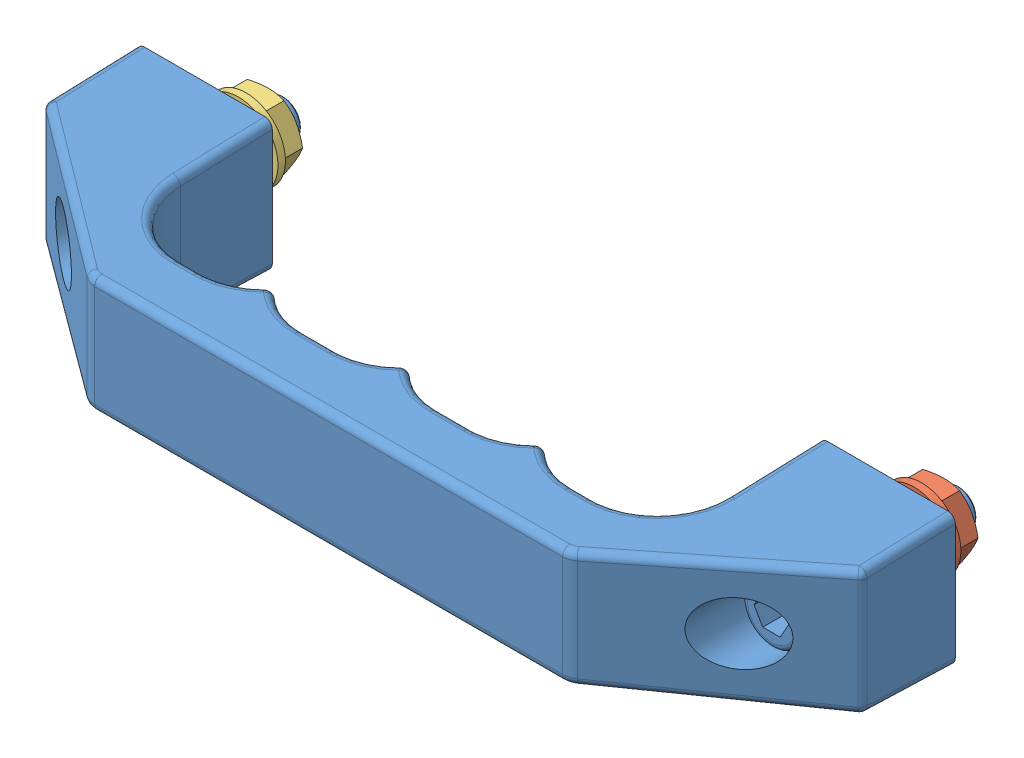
SolidWorks assembly AG1-180.sldasm, configuration Default (file format 15000). Lengths in mm.
Overall size (218 35 78).
3 component instances, 3 part files, 0 mates.
Components (placement in the parent):
- AG1-180_01-1: AG1-180_01.SLDPRT [Default] x (1 0 0) z (0 -1 0) size (218 78 35)
- AG1-180_02-1: AG1-180_02.SLDPRT [Default] at (180 0 -8) x (1 0 0) z (0 -1 0) size (21 8 21)
- AG1-180_03-1: AG1-180_03.SLDPRT [Default] at (0 0 -8) x (1 0 0) z (0 -1 0) size (21 8 21)
